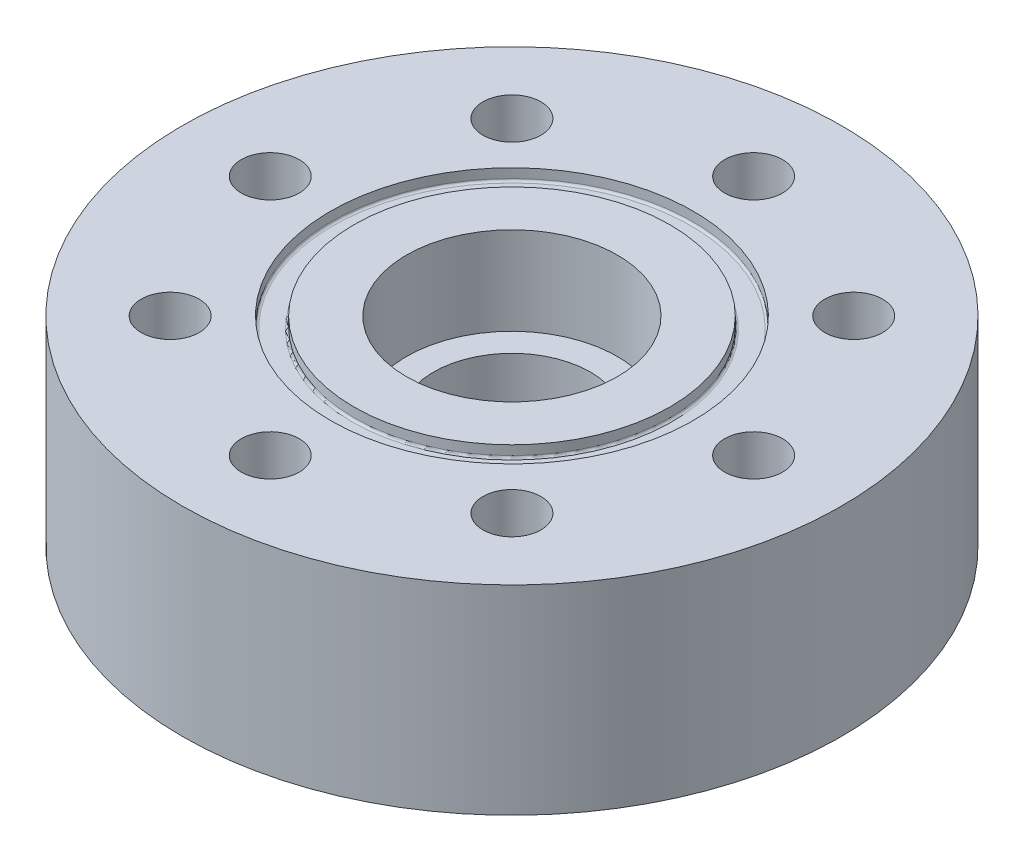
from build123d import *

# Parameters (mm, degrees)
SKETCH2_R                 = 37.5
OUTER_CYLINDER_DEPTH      = 22.7
SKETCH3_R                 = 8.93
NPT_HOLE_DEPTH            = 12.7
SKETCH4_R                 = 3.3
BOLT_HOLES_DEPTH          = 58.687000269
SKETCH5_R                 = 20.6375
SKETCH5_R_2               = 17.9705
O_RING_GROOVE_DEPTH       = 1.3208
FILLET1_R                 = 0.254
SKETCH6_R                 = 12
INLET_FLOW_DIAMETER_DEPTH = 10


with BuildPart() as part:
    # Sketch2 → Outer Cylinder (new body)
    with BuildSketch(Plane(origin=(0, 0, 0), x_dir=(1, 0, 0), z_dir=(0, 1, 0))):
        with Locations(Location((0, 0, 0), (0, 0, 270))):
            Circle(SKETCH2_R)
    extrude(amount=OUTER_CYLINDER_DEPTH)

    # Sketch3 → NPT Hole (cut)
    with BuildSketch(Plane.XZ):
        with Locations(Location((0, 0, 0), (0, 0, 270))):
            Circle(SKETCH3_R)
    extrude(amount=-NPT_HOLE_DEPTH, mode=Mode.SUBTRACT)

    # Sketch4 → Bolt Holes (cut, through all)
    with BuildSketch(Plane.XZ):
        with Locations(Location((-27.5, 0, 0), (0, 0, 270))):
            Circle(SKETCH4_R)
        with Locations(Location((-19.445436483, 19.445436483, 0), (0, 0, 270))):
            Circle(SKETCH4_R)
        with Locations(Location((0, 27.5, 0), (0, 0, 270))):
            Circle(SKETCH4_R)
        with Locations(Location((19.445436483, 19.445436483, 0), (0, 0, 270))):
            Circle(SKETCH4_R)
        with Locations(Location((27.5, 0, 0), (0, 0, 270))):
            Circle(SKETCH4_R)
        with Locations(Location((19.445436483, -19.445436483, 0), (0, 0, 270))):
            Circle(SKETCH4_R)
        with Locations(Location((0, -27.5, 0), (0, 0, 270))):
            Circle(SKETCH4_R)
        with Locations(Location((-19.445436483, -19.445436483, 0), (0, 0, 270))):
            Circle(SKETCH4_R)
    extrude(amount=-BOLT_HOLES_DEPTH, mode=Mode.SUBTRACT)

    # Sketch5 → O-Ring Groove (cut)
    with BuildSketch(Plane(origin=(0, 22.7, 0), x_dir=(1, 0, 0), z_dir=(0, 1, 0))):
        with Locations(Location((0, 0, 0), (0, 0, 270))):
            Circle(SKETCH5_R)
        with Locations(Location((0, 0, 0), (0, 0, 270))):
            Circle(SKETCH5_R_2, mode=Mode.SUBTRACT)
    extrude(amount=-O_RING_GROOVE_DEPTH, mode=Mode.SUBTRACT)

    # Fillet1
    fillet1_edges = [part.edges().sort_by_distance(p)[0] for p in [
        (0, 21.3792, -20.6375),
        (0, 21.3792, -17.9705),
    ]]
    fillet(fillet1_edges, radius=FILLET1_R)

    # Sketch6 → Inlet Flow Diameter (cut)
    with BuildSketch(Plane(origin=(0, 22.7, 0), x_dir=(1, 0, 0), z_dir=(0, 1, 0))):
        with Locations(Location((0, 0, 0), (0, 0, 270))):
            Circle(SKETCH6_R)
    extrude(amount=-INLET_FLOW_DIAMETER_DEPTH, mode=Mode.SUBTRACT)


solid = part.part
